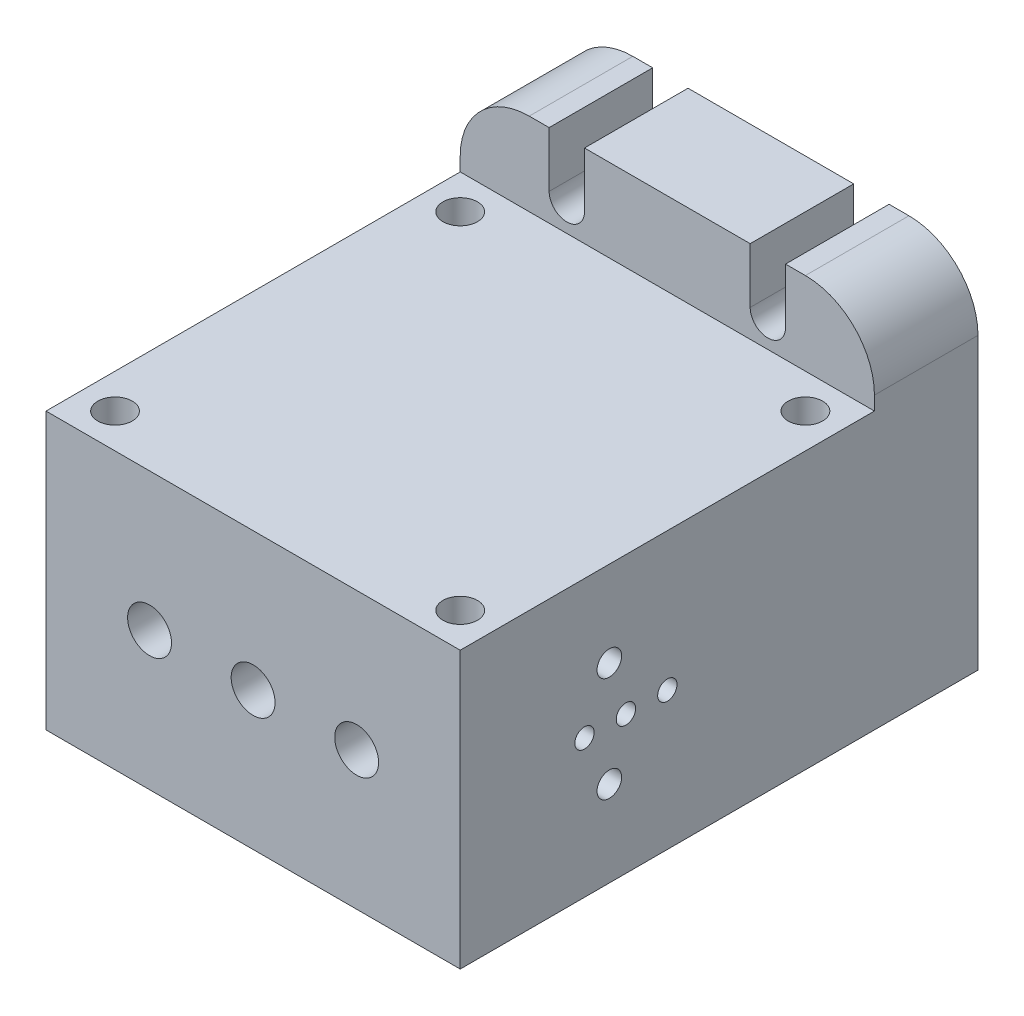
from build123d import *

# Parameters (mm, degrees)
SKETCH1_W                      = 38.1
SKETCH1_H                      = 38.1
BOSS_EXTRUDE1_DEPTH            = 25.4
F_50_0_07_DIAMETER_HOLE1_D     = 1.778
F_50_0_07_DIAMETER_HOLE1_DEPTH = 19.558
F_50_0_07_DIAMETER_HOLE1_TIP   = 0.53416509
F_50_0_07_DIAMETER_HOLE2_D     = 1.778
F_50_0_07_DIAMETER_HOLE2_DEPTH = 9.906
F_50_0_07_DIAMETER_HOLE2_TIP   = 0.53416509
F_50_0_07_DIAMETER_HOLE3_D     = 1.778
F_4_40_TAPPED_HOLE1_D          = 2.2606
F_4_40_TAPPED_HOLE1_DEPTH      = 8.89
F_4_40_TAPPED_HOLE1_TIP        = 0.679152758
F_4_40_TAPPED_HOLE2_D          = 2.2606
F_4_40_TAPPED_HOLE2_DEPTH      = 8.89
F_4_40_TAPPED_HOLE2_TIP        = 0.679152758
F_50_0_07_DIAMETER_HOLE4_D     = 1.778
F_50_0_07_DIAMETER_HOLE4_DEPTH = 11.938
F_50_0_07_DIAMETER_HOLE4_TIP   = 0.53416509
F_50_0_07_DIAMETER_HOLE5_D     = 1.778
F_50_0_07_DIAMETER_HOLE5_DEPTH = 15.748
F_50_0_07_DIAMETER_HOLE5_TIP   = 0.53416509
F_50_0_07_DIAMETER_HOLE6_D     = 1.778
F_50_0_07_DIAMETER_HOLE6_DEPTH = 10.16
F_50_0_07_DIAMETER_HOLE6_TIP   = 0.53416509
F_50_0_07_DIAMETER_HOLE7_D     = 1.778
F_50_0_07_DIAMETER_HOLE7_DEPTH = 15.748
F_50_0_07_DIAMETER_HOLE7_TIP   = 0.53416509
F_50_0_07_DIAMETER_HOLE8_D     = 1.778
F_50_0_07_DIAMETER_HOLE8_DEPTH = 19.558
F_50_0_07_DIAMETER_HOLE8_TIP   = 0.53416509
F_50_0_07_DIAMETER_HOLE9_D     = 1.778
F_50_0_07_DIAMETER_HOLE9_DEPTH = 13.208
F_50_0_07_DIAMETER_HOLE9_TIP   = 0.53416509
F_4_40_TAPPED_HOLE3_D          = 2.2606
F_4_40_TAPPED_HOLE3_DEPTH      = 8.89
F_4_40_TAPPED_HOLE3_TIP        = 0.679152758
F_4_40_TAPPED_HOLE4_D          = 2.2606
F_4_40_TAPPED_HOLE4_DEPTH      = 8.89
F_4_40_TAPPED_HOLE4_TIP        = 0.679152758
F_10_32_TAPPED_HOLE1_D         = 4.0386
F_10_32_TAPPED_HOLE1_DEPTH     = 7.874
F_10_32_TAPPED_HOLE1_TIP       = 1.213317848
F_10_32_TAPPED_HOLE2_D         = 4.0386
F_10_32_TAPPED_HOLE2_DEPTH     = 7.874
F_10_32_TAPPED_HOLE2_TIP       = 1.213317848
F_10_32_TAPPED_HOLE3_D         = 4.0386
F_10_32_TAPPED_HOLE3_DEPTH     = 7.874
F_10_32_TAPPED_HOLE3_TIP       = 1.213317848
F_1_8_0_125_DIAMETER_HOLE1_D   = 3.175
F_1_8_0_125_DIAMETER_HOLE2_D   = 3.175
F_1_8_0_125_DIAMETER_HOLE3_D   = 3.175
F_1_8_0_125_DIAMETER_HOLE4_D   = 3.175
SKETCH42_R                     = 18.0975
SKETCH42_R_2                   = 14.2875
CUT_EXTRUDE1_DEPTH             = 2.54
BOSS_EXTRUDE2_DEPTH            = 9.525
CUT_EXTRUDE4_REACH             = 55.897
FILLET1_R                      = 6.35


with BuildPart() as part:
    # Sketch1 → Boss-Extrude1 (new body)
    with BuildSketch(Plane(origin=(0, 0, 0), x_dir=(1, 0, 0), z_dir=(0, 1, 0))):
        Rectangle(SKETCH1_W, SKETCH1_H)
    extrude(amount=BOSS_EXTRUDE1_DEPTH)

    # 50 _0.07_ Diameter Hole1
    with Locations(Plane(origin=(19.05, 0, 0), x_dir=(0, 0, -1), z_dir=(1, 0, 0))):
        with Locations((-3.81, 12.7)):
            Hole(F_50_0_07_DIAMETER_HOLE1_D / 2, depth=F_50_0_07_DIAMETER_HOLE1_DEPTH)
            with Locations((0, 0, -(F_50_0_07_DIAMETER_HOLE1_DEPTH + F_50_0_07_DIAMETER_HOLE1_TIP / 2))):  # 118° drill point
                Cone(0, F_50_0_07_DIAMETER_HOLE1_D / 2, F_50_0_07_DIAMETER_HOLE1_TIP, mode=Mode.SUBTRACT)

    # 50 _0.07_ Diameter Hole2
    with Locations(Plane(origin=(19.05, 0, 0), x_dir=(0, 0, -1), z_dir=(1, 0, 0))):
        with Locations((-7.62, 12.7)):
            Hole(F_50_0_07_DIAMETER_HOLE2_D / 2, depth=F_50_0_07_DIAMETER_HOLE2_DEPTH)
            with Locations((0, 0, -(F_50_0_07_DIAMETER_HOLE2_DEPTH + F_50_0_07_DIAMETER_HOLE2_TIP / 2))):  # 118° drill point
                Cone(0, F_50_0_07_DIAMETER_HOLE2_D / 2, F_50_0_07_DIAMETER_HOLE2_TIP, mode=Mode.SUBTRACT)

    # 50 _0.07_ Diameter Hole3 (through all)
    with Locations(Plane(origin=(19.05, 0, 0), x_dir=(0, 0, -1), z_dir=(1, 0, 0))):
        with Locations((0, 12.7)):
            Hole(F_50_0_07_DIAMETER_HOLE3_D / 2)

    # 4-40 Tapped Hole1
    with Locations(Plane(origin=(19.05, 0, 0), x_dir=(0, 0, -1), z_dir=(1, 0, 0))):
        with Locations((-5.334, 7.874)):
            Hole(F_4_40_TAPPED_HOLE1_D / 2, depth=F_4_40_TAPPED_HOLE1_DEPTH)
            with Locations((0, 0, -(F_4_40_TAPPED_HOLE1_DEPTH + F_4_40_TAPPED_HOLE1_TIP / 2))):  # 118° drill point
                Cone(0, F_4_40_TAPPED_HOLE1_D / 2, F_4_40_TAPPED_HOLE1_TIP, mode=Mode.SUBTRACT)

    # 4-40 Tapped Hole2
    with Locations(Plane(origin=(19.05, 0, 0), x_dir=(0, 0, -1), z_dir=(1, 0, 0))):
        with Locations((-5.334, 17.526)):
            Hole(F_4_40_TAPPED_HOLE2_D / 2, depth=F_4_40_TAPPED_HOLE2_DEPTH)
            with Locations((0, 0, -(F_4_40_TAPPED_HOLE2_DEPTH + F_4_40_TAPPED_HOLE2_TIP / 2))):  # 118° drill point
                Cone(0, F_4_40_TAPPED_HOLE2_D / 2, F_4_40_TAPPED_HOLE2_TIP, mode=Mode.SUBTRACT)

    # 50 _0.07_ Diameter Hole4
    with Locations(Plane.XY.offset(19.05)):
        with Locations((9.525, 12.7)):
            Hole(F_50_0_07_DIAMETER_HOLE4_D / 2, depth=F_50_0_07_DIAMETER_HOLE4_DEPTH)
            with Locations((0, 0, -(F_50_0_07_DIAMETER_HOLE4_DEPTH + F_50_0_07_DIAMETER_HOLE4_TIP / 2))):  # 118° drill point
                Cone(0, F_50_0_07_DIAMETER_HOLE4_D / 2, F_50_0_07_DIAMETER_HOLE4_TIP, mode=Mode.SUBTRACT)

    # 50 _0.07_ Diameter Hole5
    with Locations(Plane.XY.offset(19.05)):
        with Locations((0, 12.7)):
            Hole(F_50_0_07_DIAMETER_HOLE5_D / 2, depth=F_50_0_07_DIAMETER_HOLE5_DEPTH)
            with Locations((0, 0, -(F_50_0_07_DIAMETER_HOLE5_DEPTH + F_50_0_07_DIAMETER_HOLE5_TIP / 2))):  # 118° drill point
                Cone(0, F_50_0_07_DIAMETER_HOLE5_D / 2, F_50_0_07_DIAMETER_HOLE5_TIP, mode=Mode.SUBTRACT)

    # 50 _0.07_ Diameter Hole6
    with Locations(Plane.ZY.offset(19.05)):
        with Locations((3.81, 12.7)):
            Hole(F_50_0_07_DIAMETER_HOLE6_D / 2, depth=F_50_0_07_DIAMETER_HOLE6_DEPTH)
            with Locations((0, 0, -(F_50_0_07_DIAMETER_HOLE6_DEPTH + F_50_0_07_DIAMETER_HOLE6_TIP / 2))):  # 118° drill point
                Cone(0, F_50_0_07_DIAMETER_HOLE6_D / 2, F_50_0_07_DIAMETER_HOLE6_TIP, mode=Mode.SUBTRACT)

    # 50 _0.07_ Diameter Hole7
    with Locations(Plane.XY.offset(19.05)):
        with Locations((-9.525, 12.7)):
            Hole(F_50_0_07_DIAMETER_HOLE7_D / 2, depth=F_50_0_07_DIAMETER_HOLE7_DEPTH)
            with Locations((0, 0, -(F_50_0_07_DIAMETER_HOLE7_DEPTH + F_50_0_07_DIAMETER_HOLE7_TIP / 2))):  # 118° drill point
                Cone(0, F_50_0_07_DIAMETER_HOLE7_D / 2, F_50_0_07_DIAMETER_HOLE7_TIP, mode=Mode.SUBTRACT)

    # 50 _0.07_ Diameter Hole8
    with Locations(Plane.ZY.offset(19.05)):
        with Locations((-3.81, 12.7)):
            Hole(F_50_0_07_DIAMETER_HOLE8_D / 2, depth=F_50_0_07_DIAMETER_HOLE8_DEPTH)
            with Locations((0, 0, -(F_50_0_07_DIAMETER_HOLE8_DEPTH + F_50_0_07_DIAMETER_HOLE8_TIP / 2))):  # 118° drill point
                Cone(0, F_50_0_07_DIAMETER_HOLE8_D / 2, F_50_0_07_DIAMETER_HOLE8_TIP, mode=Mode.SUBTRACT)

    # 50 _0.07_ Diameter Hole9
    with Locations(Plane.XZ):
        with Locations((0, -3.81)):
            Hole(F_50_0_07_DIAMETER_HOLE9_D / 2, depth=F_50_0_07_DIAMETER_HOLE9_DEPTH)
            with Locations((0, 0, -(F_50_0_07_DIAMETER_HOLE9_DEPTH + F_50_0_07_DIAMETER_HOLE9_TIP / 2))):  # 118° drill point
                Cone(0, F_50_0_07_DIAMETER_HOLE9_D / 2, F_50_0_07_DIAMETER_HOLE9_TIP, mode=Mode.SUBTRACT)

    # 4-40 Tapped Hole3
    with Locations(Plane.ZY.offset(19.05)):
        with Locations((1.524, 17.526)):
            Hole(F_4_40_TAPPED_HOLE3_D / 2, depth=F_4_40_TAPPED_HOLE3_DEPTH)
            with Locations((0, 0, -(F_4_40_TAPPED_HOLE3_DEPTH + F_4_40_TAPPED_HOLE3_TIP / 2))):  # 118° drill point
                Cone(0, F_4_40_TAPPED_HOLE3_D / 2, F_4_40_TAPPED_HOLE3_TIP, mode=Mode.SUBTRACT)

    # 4-40 Tapped Hole4
    with Locations(Plane.ZY.offset(19.05)):
        with Locations((1.524, 7.874)):
            Hole(F_4_40_TAPPED_HOLE4_D / 2, depth=F_4_40_TAPPED_HOLE4_DEPTH)
            with Locations((0, 0, -(F_4_40_TAPPED_HOLE4_DEPTH + F_4_40_TAPPED_HOLE4_TIP / 2))):  # 118° drill point
                Cone(0, F_4_40_TAPPED_HOLE4_D / 2, F_4_40_TAPPED_HOLE4_TIP, mode=Mode.SUBTRACT)

    # 10-32 Tapped Hole1
    with Locations(Plane.XY.offset(19.05)):
        with Locations((-9.525, 12.7)):
            Hole(F_10_32_TAPPED_HOLE1_D / 2, depth=F_10_32_TAPPED_HOLE1_DEPTH)
            with Locations((0, 0, -(F_10_32_TAPPED_HOLE1_DEPTH + F_10_32_TAPPED_HOLE1_TIP / 2))):  # 118° drill point
                Cone(0, F_10_32_TAPPED_HOLE1_D / 2, F_10_32_TAPPED_HOLE1_TIP, mode=Mode.SUBTRACT)

    # 10-32 Tapped Hole2
    with Locations(Plane.XY.offset(19.05)):
        with Locations((0, 12.7)):
            Hole(F_10_32_TAPPED_HOLE2_D / 2, depth=F_10_32_TAPPED_HOLE2_DEPTH)
            with Locations((0, 0, -(F_10_32_TAPPED_HOLE2_DEPTH + F_10_32_TAPPED_HOLE2_TIP / 2))):  # 118° drill point
                Cone(0, F_10_32_TAPPED_HOLE2_D / 2, F_10_32_TAPPED_HOLE2_TIP, mode=Mode.SUBTRACT)

    # 10-32 Tapped Hole3
    with Locations(Plane.XY.offset(19.05)):
        with Locations((9.525, 12.7)):
            Hole(F_10_32_TAPPED_HOLE3_D / 2, depth=F_10_32_TAPPED_HOLE3_DEPTH)
            with Locations((0, 0, -(F_10_32_TAPPED_HOLE3_DEPTH + F_10_32_TAPPED_HOLE3_TIP / 2))):  # 118° drill point
                Cone(0, F_10_32_TAPPED_HOLE3_D / 2, F_10_32_TAPPED_HOLE3_TIP, mode=Mode.SUBTRACT)

    # 1_8 _0.125_ Diameter Hole1 (through all)
    with Locations(Plane.XZ):
        with Locations((15.875, 15.875)):
            Hole(F_1_8_0_125_DIAMETER_HOLE1_D / 2)

    # 1_8 _0.125_ Diameter Hole2 (through all)
    with Locations(Plane.XZ):
        with Locations((-15.875, 15.875)):
            Hole(F_1_8_0_125_DIAMETER_HOLE2_D / 2)

    # 1_8 _0.125_ Diameter Hole3 (through all)
    with Locations(Plane.XZ):
        with Locations((15.875, -15.875)):
            Hole(F_1_8_0_125_DIAMETER_HOLE3_D / 2)

    # 1_8 _0.125_ Diameter Hole4 (through all)
    with Locations(Plane.XZ):
        with Locations((-15.875, -15.875)):
            Hole(F_1_8_0_125_DIAMETER_HOLE4_D / 2)

    # Sketch42 → Cut-Extrude1 (cut)
    with BuildSketch(Plane.XZ):
        with Locations(Location((0, 0, 0), (0, 0, 270))):
            Circle(SKETCH42_R)
        with Locations(Location((0, 0, 0), (0, 0, 270))):
            Circle(SKETCH42_R_2, mode=Mode.SUBTRACT)
    extrude(amount=-CUT_EXTRUDE1_DEPTH, mode=Mode.SUBTRACT)

    # Sketch43 → Boss-Extrude2 (add)
    with BuildSketch(Plane(origin=(0, 0, -19.05), x_dir=(-1, 0, 0), z_dir=(0, 0, -1))):
        Polygon((19.05, 0), (-19.05, 0), (-19.05, 25.4), (-19.05, 33.02), (19.05, 33.02), (19.05, 25.4), align=None)
    extrude(amount=BOSS_EXTRUDE2_DEPTH)

    # Sketch44 → Cut-Extrude4 (cut, up to next)
    with BuildSketch(Plane.XY.offset(-19.05), mode=Mode.PRIVATE) as cut_extrude4_sk1:
        with BuildLine():
            Line((-10.8712, 33.02), (-7.62, 33.02))
            Line((-7.62, 33.02), (-7.62, 27.94))
            ThreePointArc((-7.62, 27.94), (-9.2456, 26.3144), (-10.8712, 27.94))
            Line((-10.8712, 27.94), (-10.8712, 33.02))
        make_face()
    cut_extrude4_tool1 = extrude(cut_extrude4_sk1.sketch, amount=-CUT_EXTRUDE4_REACH, mode=Mode.PRIVATE) & part.part
    # Sketch44 → Cut-Extrude4 (cut, up to next)
    with BuildSketch(Plane.XY.offset(-19.05), mode=Mode.PRIVATE) as cut_extrude4_sk2:
        with BuildLine():
            Line((10.8712, 33.02), (7.62, 33.02))
            Line((7.62, 33.02), (7.62, 27.94))
            ThreePointArc((7.62, 27.94), (9.2456, 26.3144), (10.8712, 27.94))
            Line((10.8712, 27.94), (10.8712, 33.02))
        make_face()
    cut_extrude4_tool2 = extrude(cut_extrude4_sk2.sketch, amount=-CUT_EXTRUDE4_REACH, mode=Mode.PRIVATE) & part.part
    add(cut_extrude4_tool1.solids().sort_by_distance((-9.2456, 29.831274, -19.05))[0], mode=Mode.SUBTRACT)
    add(cut_extrude4_tool2.solids().sort_by_distance((9.2456, 29.831274, -19.05))[0], mode=Mode.SUBTRACT)

    # Fillet1
    fillet1_edges = [part.edges().sort_by_distance(p)[0] for p in [
        (-19.05, 33.02, -23.8125),
        (19.05, 33.02, -23.8125),
    ]]
    fillet(fillet1_edges, radius=FILLET1_R)


solid = part.part
